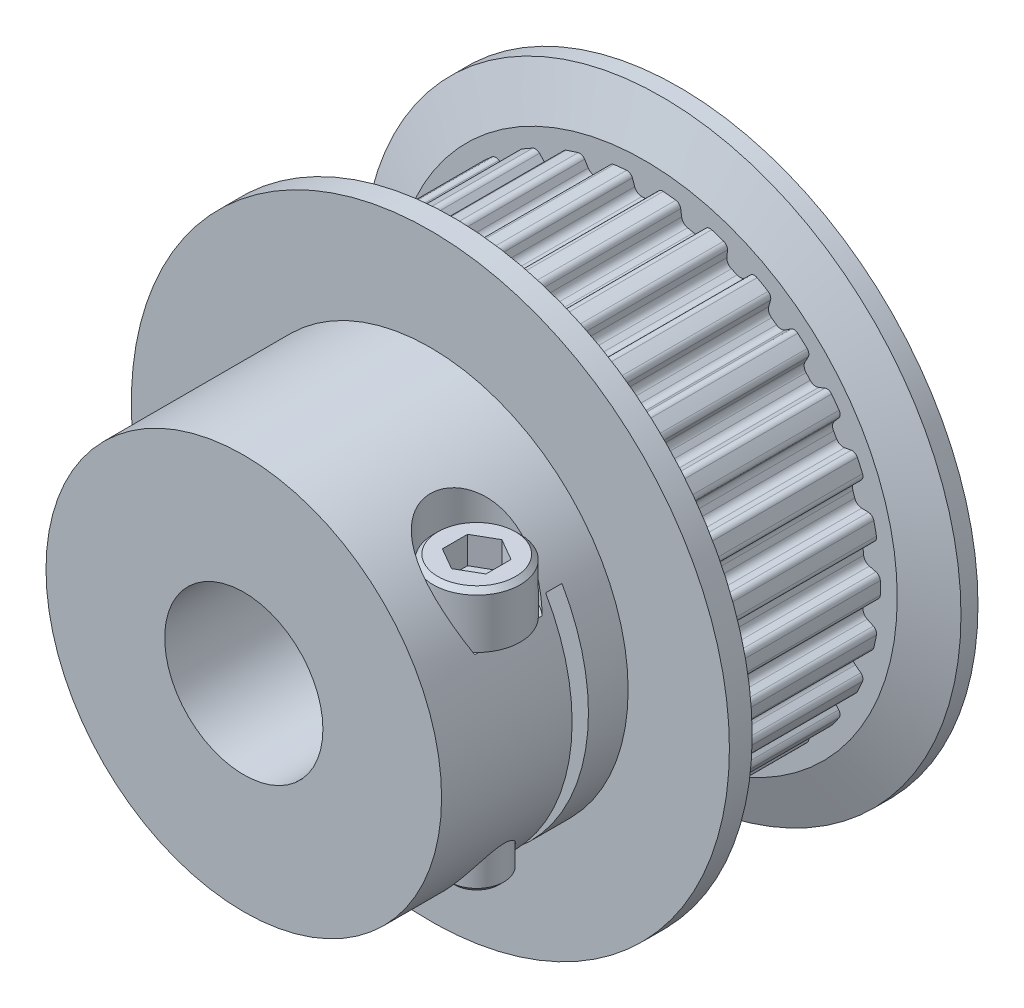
from build123d import *

# Parameters (mm, degrees)
SKETCH1_W               = 8.73125
SKETCH1_H               = 4.7625
SKETCH2_W               = 0.65484375
SKETCH2_H               = 4.7625
CUT_REVOLVE1_ANGLE      = 180
CUT_EXTRUDE1_DEPTH      = 1.0922
EXTRUDE1_START          = 7.366
SKETCH7_R               = 9.4488
SKETCH7_R_2             = 3.175
EXTRUDE1_DEPTH          = 7.366
CUT_EXTRUDE2_START      = -8.975725
CUT_EXTRUDE2_DEPTH      = 8.975725
CIRPATTERN1_COUNT       = 30
EXTRUDE2_START          = 0.682625
SKETCH10_R              = 9.4488
SKETCH10_R_2            = 3.175
EXTRUDE2_DEPTH          = 0.682625
SKETCH12_R              = 6.3373
SKETCH12_R_2            = 6.2865
CUT_EXTRUDE_THIN1_DEPTH = 0.0508


with BuildPart() as part:
    # Sketch1 → Revolve1 (revolve)
    with BuildSketch(Plane(origin=(0, 0, 0), x_dir=(0, 0, -1), z_dir=(1, 0, 0)), mode=Mode.PRIVATE) as revolve1_sk:
        with Locations((-4.365625, 5.55625)):
            Rectangle(SKETCH1_W, SKETCH1_H)
    revolve(revolve1_sk.sketch.rotate(Axis((0, 0, 9.1678125), (0, 0, -1)), 90), axis=Axis((0, 0, 9.1678125), (0, 0, -1)))

    # Sketch2 → Cut-Revolve1 (revolve, cut)
    with BuildSketch(Plane(origin=(0, 0, 0), x_dir=(0, 0, -1), z_dir=(-0.49999999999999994, 0.8660254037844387, 0))):
        with Locations((-3.165078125, 5.55625)):
            Rectangle(SKETCH2_W, SKETCH2_H)
    revolve(axis=Axis((0, 0, 3.525242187), (0, 0, 1)), revolution_arc=CUT_REVOLVE1_ANGLE, mode=Mode.SUBTRACT)

    # Sketch4 → Cut-Revolve2 (revolve, cut)
    with BuildSketch(Plane.XY.offset(5.23875), mode=Mode.PRIVATE) as cut_revolve2_sk:
        Polygon((3.99796, 6.857129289), (3.99796, 3.4925), (4.751578, 3.4925), (4.751578, -6.358176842), (5.8547, -6.358176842), (5.8547, 6.857129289), align=None)
    revolve(cut_revolve2_sk.sketch.rotate(Axis((5.8547, -7.018942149, 5.23875), (0, 1, 0)), 90), axis=Axis((5.8547, -7.018942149, 5.23875), (0, 1, 0)), mode=Mode.SUBTRACT)

    # Sketch5 → Revolve2 (revolve)
    with BuildSketch(Plane(origin=(5.8547, 0, 5.23875), x_dir=(1, 0, 0), z_dir=(0, 0, 1)), mode=Mode.PRIVATE) as revolve2_sk:
        Polygon((1.74752, 5.4864), (1.74752, 3.4925), (1.0922, 3.4925), (1.0922, -5.169200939), (0.9017, -5.359700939), (0, -5.359700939), (0, 5.6769), (1.55702, 5.6769), align=None)
    revolve(revolve2_sk.sketch.rotate(Axis((5.8547, -5.911530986, 5.23875), (0, 1, 0)), 90), axis=Axis((5.8547, -5.911530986, 5.23875), (0, 1, 0)))

    # Sketch6 → Cut-Extrude1 (cut)
    with BuildSketch(Plane(origin=(0, 5.6769, 0), x_dir=(-1, 0, 0), z_dir=(0, 1, 0))):
        Polygon((-5.8547, 4.229818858), (-4.98094, 4.734284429), (-4.98094, 5.743215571), (-5.8547, 6.247681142), (-6.72846, 5.743215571), (-6.72846, 4.734284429), align=None)
    extrude(amount=-CUT_EXTRUDE1_DEPTH, mode=Mode.SUBTRACT)

    # Sketch7 → Extrude1 (add)
    with BuildSketch(Plane(origin=(0, 0, 0), x_dir=(-1, 0, 0), z_dir=(0, 0, -1)).offset(EXTRUDE1_START)):
        Circle(SKETCH7_R)
        with Locations(Location((0, 0, 0), (0, 0, 180))):
            Circle(SKETCH7_R_2, mode=Mode.SUBTRACT)
    extrude(amount=-EXTRUDE1_DEPTH)

    # Sketch8 → Cut-Extrude2 (cut)
    with BuildSketch(Plane(origin=(0, 0, 0), x_dir=(0.9781476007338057, -0.20791169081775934, 0), z_dir=(0, 0, 1)).offset(CUT_EXTRUDE2_START)):
        with BuildLine():
            Line((0.123126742, 8.8138), (-0.123126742, 8.8138))
            ThreePointArc((-0.123126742, 8.8138), (-0.29795284, 8.868922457), (-0.409545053, 9.01435226))
            Line((-0.409545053, 9.01435226), (-0.502746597, 9.270421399))
            ThreePointArc((-0.502746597, 9.270421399), (-0.593832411, 9.384457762), (-0.735351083, 9.420142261))
            ThreePointArc((-0.735351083, 9.420142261), (0, 9.4488), (0.735351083, 9.420142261))
            ThreePointArc((0.735351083, 9.420142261), (0.593832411, 9.384457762), (0.502746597, 9.270421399))
            Line((0.502746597, 9.270421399), (0.409545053, 9.01435226))
            ThreePointArc((0.409545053, 9.01435226), (0.29795284, 8.868922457), (0.123126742, 8.8138))
        make_face()
    cut_extrude2 = extrude(amount=CUT_EXTRUDE2_DEPTH, mode=Mode.SUBTRACT)

    # CirPattern1: Cut-Extrude2 ×30 about axis
    cirpattern1_axis = Axis((0, 0, 0), (0, 0, 1))
    for i in range(1, CIRPATTERN1_COUNT):
        add(cut_extrude2.rotate(cirpattern1_axis, i * 360 / CIRPATTERN1_COUNT), mode=Mode.SUBTRACT)

    # Sketch9 → Revolve3 (revolve)
    with BuildSketch(Plane(origin=(0, 0, 0), x_dir=(0, 0, -1), z_dir=(1, 0, 0)), mode=Mode.PRIVATE) as revolve3_sk:
        Polygon((7.366, 3.175), (7.366, 10.126003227), (8.048625, 12.0015), (8.73125, 12.0015), (8.048625, 10.126003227), (8.048625, 3.175), align=None)
    revolve(revolve3_sk.sketch.rotate(Axis((0, 0, 0.4365625), (0, 0, -1)), 90), axis=Axis((0, 0, 0.4365625), (0, 0, -1)))

    # Sketch10 → Extrude2 (add)
    with BuildSketch(Plane(origin=(0, 0, -8.048625), x_dir=(-1, 0, 0), z_dir=(0, 0, -1)).offset(EXTRUDE2_START)):
        with Locations(Location((0, 0, 0), (0, 0, 180))):
            Circle(SKETCH10_R)
        with Locations(Location((0, 0, 0), (0, 0, 180))):
            Circle(SKETCH10_R_2, mode=Mode.SUBTRACT)
    extrude(amount=-EXTRUDE2_DEPTH)

    # Sketch11 → Revolve4 (revolve)
    with BuildSketch(Plane(origin=(0, 0, 0), x_dir=(0, 0, -1), z_dir=(1, 0, 0)), mode=Mode.PRIVATE) as revolve4_sk:
        Polygon((0, 3.175), (0, 10.126003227), (-0.330700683, 12.0015), (-1.2446, 12.0015), (-1.2446, 3.175), align=None)
    revolve(revolve4_sk.sketch.rotate(Axis((0, 0, 1.67513), (0, 0, -1)), 90), axis=Axis((0, 0, 1.67513), (0, 0, -1)))

    # Sketch12 → Cut-Extrude-Thin1 (cut)
    with BuildSketch(Plane(origin=(0, 0, -8.73125), x_dir=(-1, 0, 0), z_dir=(0, 0, -1))):
        Circle(SKETCH12_R)
        Circle(SKETCH12_R_2, mode=Mode.SUBTRACT)
    extrude(amount=-CUT_EXTRUDE_THIN1_DEPTH, mode=Mode.SUBTRACT)


solid = part.part
